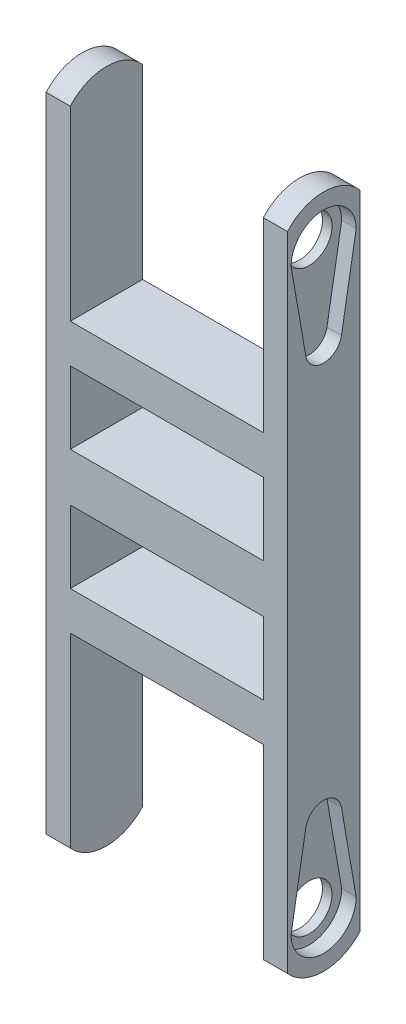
ISO-10303-21;
HEADER;
FILE_DESCRIPTION(('STEP AP214'),'2;1');
FILE_NAME('part.step','',(''),(''),'','','');
FILE_SCHEMA(('AUTOMOTIVE_DESIGN { 1 0 10303 214 1 1 1 1 }'));
ENDSEC;
DATA;
#1=APPLICATION_CONTEXT('core data for automotive mechanical design processes');
#2=APPLICATION_PROTOCOL_DEFINITION('international standard','automotive_design',2000,#1);
#3=PRODUCT_CONTEXT('',#1,'mechanical');
#4=PRODUCT('Part','Part','',(#3));
#5=PRODUCT_RELATED_PRODUCT_CATEGORY('part','',(#4));
#6=PRODUCT_DEFINITION_FORMATION('','',#4);
#7=PRODUCT_DEFINITION_CONTEXT('part definition',#1,'design');
#8=PRODUCT_DEFINITION('design','',#6,#7);
#9=PRODUCT_DEFINITION_SHAPE('','',#8);
#10=(LENGTH_UNIT() NAMED_UNIT(*) SI_UNIT(.MILLI.,.METRE.));
#11=(NAMED_UNIT(*) PLANE_ANGLE_UNIT() SI_UNIT($,.RADIAN.));
#12=(NAMED_UNIT(*) SI_UNIT($,.STERADIAN.) SOLID_ANGLE_UNIT());
#13=UNCERTAINTY_MEASURE_WITH_UNIT(LENGTH_MEASURE(1.E-05),#10,'distance_accuracy_value','');
#14=(GEOMETRIC_REPRESENTATION_CONTEXT(3) GLOBAL_UNCERTAINTY_ASSIGNED_CONTEXT((#13)) GLOBAL_UNIT_ASSIGNED_CONTEXT((#10,
#11,#12)) REPRESENTATION_CONTEXT('',''));
#15=CARTESIAN_POINT('',(0.,0.,0.));
#16=DIRECTION('',(0.,0.,1.));
#17=DIRECTION('',(1.,0.,0.));
#18=AXIS2_PLACEMENT_3D('',#15,#16,#17);
#19=CARTESIAN_POINT('',(-30.001,60.,7.49999999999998));
#20=DIRECTION('',(1.,0.,0.));
#21=DIRECTION('',(0.,0.,-1.));
#22=AXIS2_PLACEMENT_3D('',#19,#20,#21);
#23=CYLINDRICAL_SURFACE('',#22,4.75);
#24=CARTESIAN_POINT('',(20.025,60.,7.49999999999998));
#25=DIRECTION('',(1.,0.,0.));
#26=DIRECTION('',(0.,1.,0.));
#27=AXIS2_PLACEMENT_3D('',#24,#25,#26);
#28=CIRCLE('',#27,4.75);
#29=CARTESIAN_POINT('',(20.025,64.75,7.49999999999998));
#30=VERTEX_POINT('',#29);
#31=EDGE_CURVE('E309',#30,#30,#28,.F.);
#32=ORIENTED_EDGE('',*,*,#31,.T.);
#33=EDGE_LOOP('',(#32));
#34=FACE_BOUND('',#33,.T.);
#35=CARTESIAN_POINT('',(22.0125,60.,7.49999999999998));
#36=DIRECTION('',(1.,0.,0.));
#37=DIRECTION('',(0.,0.,-1.));
#38=AXIS2_PLACEMENT_3D('',#35,#36,#37);
#39=CIRCLE('',#38,4.75);
#40=CARTESIAN_POINT('',(22.0125,60.,2.74999999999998));
#41=VERTEX_POINT('',#40);
#42=EDGE_CURVE('E38',#41,#41,#39,.F.);
#43=ORIENTED_EDGE('',*,*,#42,.F.);
#44=EDGE_LOOP('',(#43));
#45=FACE_BOUND('',#44,.T.);
#46=ADVANCED_FACE('F34',(#34,#45),#23,.F.);
#47=CARTESIAN_POINT('',(-20.025,-70.,0.));
#48=DIRECTION('',(-1.,0.,0.));
#49=DIRECTION('',(0.,-1.,0.));
#50=AXIS2_PLACEMENT_3D('',#47,#48,#49);
#51=PLANE('',#50);
#52=DIRECTION('',(0.,-1.,0.));
#53=VECTOR('',#52,1.);
#54=CARTESIAN_POINT('',(-20.025,-70.,15.));
#55=LINE('',#54,#53);
#56=CARTESIAN_POINT('',(-20.025,-28.,15.));
#57=VERTEX_POINT('',#56);
#58=CARTESIAN_POINT('',(-20.025,-66.6143782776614,15.));
#59=VERTEX_POINT('',#58);
#60=EDGE_CURVE('E361',#57,#59,#55,.T.);
#61=ORIENTED_EDGE('',*,*,#60,.T.);
#62=CARTESIAN_POINT('',(-20.025,-60.,7.49999999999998));
#63=DIRECTION('',(-1.,0.,0.));
#64=DIRECTION('',(0.,-1.,0.));
#65=AXIS2_PLACEMENT_3D('',#62,#63,#64);
#66=CIRCLE('',#65,10.);
#67=CARTESIAN_POINT('',(-20.025,-66.6143782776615,0.));
#68=VERTEX_POINT('',#67);
#69=EDGE_CURVE('E330',#59,#68,#66,.F.);
#70=ORIENTED_EDGE('',*,*,#69,.T.);
#71=DIRECTION('',(0.,-1.,0.));
#72=VECTOR('',#71,1.);
#73=CARTESIAN_POINT('',(-20.025,-70.,0.));
#74=LINE('',#73,#72);
#75=CARTESIAN_POINT('',(-20.025,-28.,0.));
#76=VERTEX_POINT('',#75);
#77=EDGE_CURVE('E422',#76,#68,#74,.T.);
#78=ORIENTED_EDGE('',*,*,#77,.F.);
#79=DIRECTION('',(0.,0.,1.));
#80=VECTOR('',#79,1.);
#81=CARTESIAN_POINT('',(-20.025,-28.,0.));
#82=LINE('',#81,#80);
#83=EDGE_CURVE('E412',#76,#57,#82,.T.);
#84=ORIENTED_EDGE('',*,*,#83,.T.);
#85=EDGE_LOOP('',(#61,#70,#78,#84));
#86=FACE_BOUND('',#85,.T.);
#87=ADVANCED_FACE('F451',(#86),#51,.F.);
#88=CARTESIAN_POINT('',(20.025,-70.,0.));
#89=DIRECTION('',(1.,0.,0.));
#90=DIRECTION('',(0.,1.,0.));
#91=AXIS2_PLACEMENT_3D('',#88,#89,#90);
#92=PLANE('',#91);
#93=CARTESIAN_POINT('',(20.025,-60.,7.49999999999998));
#94=DIRECTION('',(1.,0.,0.));
#95=DIRECTION('',(0.,1.,0.));
#96=AXIS2_PLACEMENT_3D('',#93,#94,#95);
#97=CIRCLE('',#96,4.75);
#98=CARTESIAN_POINT('',(20.025,-55.25,7.49999999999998));
#99=VERTEX_POINT('',#98);
#100=EDGE_CURVE('E308',#99,#99,#97,.F.);
#101=ORIENTED_EDGE('',*,*,#100,.F.);
#102=EDGE_LOOP('',(#101));
#103=FACE_BOUND('',#102,.T.);
#104=DIRECTION('',(0.,1.,0.));
#105=VECTOR('',#104,1.);
#106=CARTESIAN_POINT('',(20.025,-70.,0.));
#107=LINE('',#106,#105);
#108=CARTESIAN_POINT('',(20.025,-66.6143782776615,0.));
#109=VERTEX_POINT('',#108);
#110=CARTESIAN_POINT('',(20.025,-28.,0.));
#111=VERTEX_POINT('',#110);
#112=EDGE_CURVE('E425',#109,#111,#107,.T.);
#113=ORIENTED_EDGE('',*,*,#112,.F.);
#114=CARTESIAN_POINT('',(20.025,-60.,7.49999999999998));
#115=DIRECTION('',(1.,0.,0.));
#116=DIRECTION('',(0.,1.,0.));
#117=AXIS2_PLACEMENT_3D('',#114,#115,#116);
#118=CIRCLE('',#117,10.);
#119=CARTESIAN_POINT('',(20.025,-66.6143782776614,15.));
#120=VERTEX_POINT('',#119);
#121=EDGE_CURVE('E43',#109,#120,#118,.F.);
#122=ORIENTED_EDGE('',*,*,#121,.T.);
#123=DIRECTION('',(0.,1.,0.));
#124=VECTOR('',#123,1.);
#125=CARTESIAN_POINT('',(20.025,-70.,15.));
#126=LINE('',#125,#124);
#127=CARTESIAN_POINT('',(20.025,-28.,15.));
#128=VERTEX_POINT('',#127);
#129=EDGE_CURVE('E434',#120,#128,#126,.T.);
#130=ORIENTED_EDGE('',*,*,#129,.T.);
#131=DIRECTION('',(0.,0.,1.));
#132=VECTOR('',#131,1.);
#133=CARTESIAN_POINT('',(20.025,-28.,0.));
#134=LINE('',#133,#132);
#135=EDGE_CURVE('E431',#111,#128,#134,.T.);
#136=ORIENTED_EDGE('',*,*,#135,.F.);
#137=EDGE_LOOP('',(#113,#122,#130,#136));
#138=FACE_BOUND('',#137,.T.);
#139=ADVANCED_FACE('F457',(#103,#138),#92,.F.);
#140=CARTESIAN_POINT('',(-20.025,70.,0.));
#141=DIRECTION('',(-1.,0.,0.));
#142=DIRECTION('',(0.,-1.,0.));
#143=AXIS2_PLACEMENT_3D('',#140,#141,#142);
#144=PLANE('',#143);
#145=DIRECTION('',(0.,-1.,0.));
#146=VECTOR('',#145,1.);
#147=CARTESIAN_POINT('',(-20.025,70.,0.));
#148=LINE('',#147,#146);
#149=CARTESIAN_POINT('',(-20.025,66.6143782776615,0.));
#150=VERTEX_POINT('',#149);
#151=CARTESIAN_POINT('',(-20.025,28.,0.));
#152=VERTEX_POINT('',#151);
#153=EDGE_CURVE('E399',#150,#152,#148,.T.);
#154=ORIENTED_EDGE('',*,*,#153,.F.);
#155=CARTESIAN_POINT('',(-20.025,60.,7.49999999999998));
#156=DIRECTION('',(-1.,0.,0.));
#157=DIRECTION('',(0.,-1.,0.));
#158=AXIS2_PLACEMENT_3D('',#155,#156,#157);
#159=CIRCLE('',#158,10.);
#160=CARTESIAN_POINT('',(-20.025,66.6143782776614,15.));
#161=VERTEX_POINT('',#160);
#162=EDGE_CURVE('E319',#150,#161,#159,.F.);
#163=ORIENTED_EDGE('',*,*,#162,.T.);
#164=DIRECTION('',(0.,-1.,0.));
#165=VECTOR('',#164,1.);
#166=CARTESIAN_POINT('',(-20.025,70.,15.));
#167=LINE('',#166,#165);
#168=CARTESIAN_POINT('',(-20.025,28.,15.));
#169=VERTEX_POINT('',#168);
#170=EDGE_CURVE('E409',#161,#169,#167,.T.);
#171=ORIENTED_EDGE('',*,*,#170,.T.);
#172=DIRECTION('',(0.,0.,1.));
#173=VECTOR('',#172,1.);
#174=CARTESIAN_POINT('',(-20.025,28.,0.));
#175=LINE('',#174,#173);
#176=EDGE_CURVE('E408',#152,#169,#175,.T.);
#177=ORIENTED_EDGE('',*,*,#176,.F.);
#178=EDGE_LOOP('',(#154,#163,#171,#177));
#179=FACE_BOUND('',#178,.T.);
#180=ADVANCED_FACE('F514',(#179),#144,.F.);
#181=CARTESIAN_POINT('',(20.025,70.,0.));
#182=DIRECTION('',(1.,0.,0.));
#183=DIRECTION('',(0.,1.,0.));
#184=AXIS2_PLACEMENT_3D('',#181,#182,#183);
#185=PLANE('',#184);
#186=ORIENTED_EDGE('',*,*,#31,.F.);
#187=EDGE_LOOP('',(#186));
#188=FACE_BOUND('',#187,.T.);
#189=CARTESIAN_POINT('',(20.025,60.,7.49999999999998));
#190=DIRECTION('',(1.,0.,0.));
#191=DIRECTION('',(0.,1.,0.));
#192=AXIS2_PLACEMENT_3D('',#189,#190,#191);
#193=CIRCLE('',#192,10.);
#194=CARTESIAN_POINT('',(20.025,66.6143782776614,15.));
#195=VERTEX_POINT('',#194);
#196=CARTESIAN_POINT('',(20.025,66.6143782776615,0.));
#197=VERTEX_POINT('',#196);
#198=EDGE_CURVE('E419',#195,#197,#193,.F.);
#199=ORIENTED_EDGE('',*,*,#198,.T.);
#200=DIRECTION('',(0.,1.,0.));
#201=VECTOR('',#200,1.);
#202=CARTESIAN_POINT('',(20.025,70.,0.));
#203=LINE('',#202,#201);
#204=CARTESIAN_POINT('',(20.025,28.,0.));
#205=VERTEX_POINT('',#204);
#206=EDGE_CURVE('E405',#205,#197,#203,.T.);
#207=ORIENTED_EDGE('',*,*,#206,.F.);
#208=DIRECTION('',(0.,0.,1.));
#209=VECTOR('',#208,1.);
#210=CARTESIAN_POINT('',(20.025,28.,0.));
#211=LINE('',#210,#209);
#212=CARTESIAN_POINT('',(20.025,28.,15.));
#213=VERTEX_POINT('',#212);
#214=EDGE_CURVE('E417',#205,#213,#211,.T.);
#215=ORIENTED_EDGE('',*,*,#214,.T.);
#216=DIRECTION('',(0.,1.,0.));
#217=VECTOR('',#216,1.);
#218=CARTESIAN_POINT('',(20.025,70.,15.));
#219=LINE('',#218,#217);
#220=EDGE_CURVE('E402',#213,#195,#219,.T.);
#221=ORIENTED_EDGE('',*,*,#220,.T.);
#222=EDGE_LOOP('',(#199,#207,#215,#221));
#223=FACE_BOUND('',#222,.T.);
#224=ADVANCED_FACE('F510',(#188,#223),#185,.F.);
#225=CARTESIAN_POINT('',(0.,0.,15.));
#226=DIRECTION('',(0.,0.,-1.));
#227=DIRECTION('',(-1.,0.,0.));
#228=AXIS2_PLACEMENT_3D('',#225,#226,#227);
#229=PLANE('',#228);
#230=DIRECTION('',(1.,0.,0.));
#231=VECTOR('',#230,1.);
#232=CARTESIAN_POINT('',(-20.025,-20.,15.));
#233=LINE('',#232,#231);
#234=CARTESIAN_POINT('',(-20.025,-20.,15.));
#235=VERTEX_POINT('',#234);
#236=CARTESIAN_POINT('',(20.025,-20.,15.));
#237=VERTEX_POINT('',#236);
#238=EDGE_CURVE('E350',#235,#237,#233,.T.);
#239=ORIENTED_EDGE('',*,*,#238,.F.);
#240=DIRECTION('',(0.,-1.,0.));
#241=VECTOR('',#240,1.);
#242=CARTESIAN_POINT('',(-20.025,-20.,15.));
#243=LINE('',#242,#241);
#244=CARTESIAN_POINT('',(-20.025,-4.99999999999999,15.));
#245=VERTEX_POINT('',#244);
#246=EDGE_CURVE('E348',#245,#235,#243,.T.);
#247=ORIENTED_EDGE('',*,*,#246,.F.);
#248=DIRECTION('',(-1.,0.,0.));
#249=VECTOR('',#248,1.);
#250=CARTESIAN_POINT('',(-20.025,-4.99999999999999,15.));
#251=LINE('',#250,#249);
#252=CARTESIAN_POINT('',(20.025,-4.99999999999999,15.));
#253=VERTEX_POINT('',#252);
#254=EDGE_CURVE('E338',#253,#245,#251,.T.);
#255=ORIENTED_EDGE('',*,*,#254,.F.);
#256=DIRECTION('',(0.,1.,0.));
#257=VECTOR('',#256,1.);
#258=CARTESIAN_POINT('',(20.025,-20.,15.));
#259=LINE('',#258,#257);
#260=EDGE_CURVE('E354',#237,#253,#259,.T.);
#261=ORIENTED_EDGE('',*,*,#260,.F.);
#262=EDGE_LOOP('',(#239,#247,#255,#261));
#263=FACE_BOUND('',#262,.T.);
#264=DIRECTION('',(1.,0.,0.));
#265=VECTOR('',#264,1.);
#266=CARTESIAN_POINT('',(-20.025,4.99999999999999,15.));
#267=LINE('',#266,#265);
#268=CARTESIAN_POINT('',(-20.025,4.99999999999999,15.));
#269=VERTEX_POINT('',#268);
#270=CARTESIAN_POINT('',(20.025,4.99999999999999,15.));
#271=VERTEX_POINT('',#270);
#272=EDGE_CURVE('E384',#269,#271,#267,.T.);
#273=ORIENTED_EDGE('',*,*,#272,.F.);
#274=DIRECTION('',(0.,-1.,0.));
#275=VECTOR('',#274,1.);
#276=CARTESIAN_POINT('',(-20.025,20.,15.));
#277=LINE('',#276,#275);
#278=CARTESIAN_POINT('',(-20.025,20.,15.));
#279=VERTEX_POINT('',#278);
#280=EDGE_CURVE('E382',#279,#269,#277,.T.);
#281=ORIENTED_EDGE('',*,*,#280,.F.);
#282=DIRECTION('',(-1.,0.,0.));
#283=VECTOR('',#282,1.);
#284=CARTESIAN_POINT('',(-20.025,20.,15.));
#285=LINE('',#284,#283);
#286=CARTESIAN_POINT('',(20.025,20.,15.));
#287=VERTEX_POINT('',#286);
#288=EDGE_CURVE('E372',#287,#279,#285,.T.);
#289=ORIENTED_EDGE('',*,*,#288,.F.);
#290=DIRECTION('',(0.,1.,0.));
#291=VECTOR('',#290,1.);
#292=CARTESIAN_POINT('',(20.025,20.,15.));
#293=LINE('',#292,#291);
#294=EDGE_CURVE('E387',#271,#287,#293,.T.);
#295=ORIENTED_EDGE('',*,*,#294,.F.);
#296=EDGE_LOOP('',(#273,#281,#289,#295));
#297=FACE_BOUND('',#296,.T.);
#298=DIRECTION('',(-1.,0.,0.));
#299=VECTOR('',#298,1.);
#300=CARTESIAN_POINT('',(30.,66.6143782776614,15.));
#301=LINE('',#300,#299);
#302=CARTESIAN_POINT('',(-25.0125,66.6143782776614,15.));
#303=VERTEX_POINT('',#302);
#304=EDGE_CURVE('E320',#161,#303,#301,.T.);
#305=ORIENTED_EDGE('',*,*,#304,.T.);
#306=DIRECTION('',(0.,-1.,0.));
#307=VECTOR('',#306,1.);
#308=CARTESIAN_POINT('',(-25.0125,70.,15.));
#309=LINE('',#308,#307);
#310=CARTESIAN_POINT('',(-25.0125,-66.6143782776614,15.));
#311=VERTEX_POINT('',#310);
#312=EDGE_CURVE('E291',#303,#311,#309,.T.);
#313=ORIENTED_EDGE('',*,*,#312,.T.);
#314=DIRECTION('',(-1.,0.,0.));
#315=VECTOR('',#314,1.);
#316=CARTESIAN_POINT('',(30.,-66.6143782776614,15.));
#317=LINE('',#316,#315);
#318=EDGE_CURVE('E331',#311,#59,#317,.F.);
#319=ORIENTED_EDGE('',*,*,#318,.T.);
#320=ORIENTED_EDGE('',*,*,#60,.F.);
#321=DIRECTION('',(-1.,0.,0.));
#322=VECTOR('',#321,1.);
#323=CARTESIAN_POINT('',(-20.025,-28.,15.));
#324=LINE('',#323,#322);
#325=EDGE_CURVE('E426',#128,#57,#324,.T.);
#326=ORIENTED_EDGE('',*,*,#325,.F.);
#327=ORIENTED_EDGE('',*,*,#129,.F.);
#328=CARTESIAN_POINT('',(25.0125,-66.6143782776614,15.));
#329=VERTEX_POINT('',#328);
#330=EDGE_CURVE('E326',#120,#329,#317,.F.);
#331=ORIENTED_EDGE('',*,*,#330,.T.);
#332=DIRECTION('',(0.,1.,0.));
#333=VECTOR('',#332,1.);
#334=CARTESIAN_POINT('',(25.0125,70.,15.));
#335=LINE('',#334,#333);
#336=CARTESIAN_POINT('',(25.0125,66.6143782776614,15.));
#337=VERTEX_POINT('',#336);
#338=EDGE_CURVE('E297',#329,#337,#335,.T.);
#339=ORIENTED_EDGE('',*,*,#338,.T.);
#340=EDGE_CURVE('E316',#337,#195,#301,.T.);
#341=ORIENTED_EDGE('',*,*,#340,.T.);
#342=ORIENTED_EDGE('',*,*,#220,.F.);
#343=DIRECTION('',(1.,0.,0.));
#344=VECTOR('',#343,1.);
#345=CARTESIAN_POINT('',(-20.025,28.,15.));
#346=LINE('',#345,#344);
#347=EDGE_CURVE('E411',#169,#213,#346,.T.);
#348=ORIENTED_EDGE('',*,*,#347,.F.);
#349=ORIENTED_EDGE('',*,*,#170,.F.);
#350=EDGE_LOOP('',(#305,#313,#319,#320,#326,#327,#331,#339,#341,#342,#348,#349));
#351=FACE_BOUND('',#350,.T.);
#352=ADVANCED_FACE('F513',(#263,#297,#351),#229,.F.);
#353=CARTESIAN_POINT('',(0.,0.,0.));
#354=DIRECTION('',(0.,0.,-1.));
#355=DIRECTION('',(-1.,0.,0.));
#356=AXIS2_PLACEMENT_3D('',#353,#354,#355);
#357=PLANE('',#356);
#358=DIRECTION('',(0.,-1.,0.));
#359=VECTOR('',#358,1.);
#360=CARTESIAN_POINT('',(-25.0125,70.,0.));
#361=LINE('',#360,#359);
#362=CARTESIAN_POINT('',(-25.0125,66.6143782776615,0.));
#363=VERTEX_POINT('',#362);
#364=CARTESIAN_POINT('',(-25.0125,-66.6143782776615,0.));
#365=VERTEX_POINT('',#364);
#366=EDGE_CURVE('E295',#363,#365,#361,.T.);
#367=ORIENTED_EDGE('',*,*,#366,.F.);
#368=DIRECTION('',(-1.,0.,0.));
#369=VECTOR('',#368,1.);
#370=CARTESIAN_POINT('',(30.,66.6143782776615,0.));
#371=LINE('',#370,#369);
#372=EDGE_CURVE('E317',#150,#363,#371,.T.);
#373=ORIENTED_EDGE('',*,*,#372,.F.);
#374=ORIENTED_EDGE('',*,*,#153,.T.);
#375=DIRECTION('',(1.,0.,0.));
#376=VECTOR('',#375,1.);
#377=CARTESIAN_POINT('',(-20.025,28.,0.));
#378=LINE('',#377,#376);
#379=EDGE_CURVE('E401',#152,#205,#378,.T.);
#380=ORIENTED_EDGE('',*,*,#379,.T.);
#381=ORIENTED_EDGE('',*,*,#206,.T.);
#382=CARTESIAN_POINT('',(25.0125,66.6143782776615,0.));
#383=VERTEX_POINT('',#382);
#384=EDGE_CURVE('E312',#383,#197,#371,.T.);
#385=ORIENTED_EDGE('',*,*,#384,.F.);
#386=DIRECTION('',(0.,1.,0.));
#387=VECTOR('',#386,1.);
#388=CARTESIAN_POINT('',(25.0125,70.,0.));
#389=LINE('',#388,#387);
#390=CARTESIAN_POINT('',(25.0125,-66.6143782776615,0.));
#391=VERTEX_POINT('',#390);
#392=EDGE_CURVE('E300',#391,#383,#389,.T.);
#393=ORIENTED_EDGE('',*,*,#392,.F.);
#394=DIRECTION('',(-1.,0.,0.));
#395=VECTOR('',#394,1.);
#396=CARTESIAN_POINT('',(30.,-66.6143782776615,0.));
#397=LINE('',#396,#395);
#398=EDGE_CURVE('E323',#109,#391,#397,.F.);
#399=ORIENTED_EDGE('',*,*,#398,.F.);
#400=ORIENTED_EDGE('',*,*,#112,.T.);
#401=DIRECTION('',(-1.,0.,0.));
#402=VECTOR('',#401,1.);
#403=CARTESIAN_POINT('',(-20.025,-28.,0.));
#404=LINE('',#403,#402);
#405=EDGE_CURVE('E428',#111,#76,#404,.T.);
#406=ORIENTED_EDGE('',*,*,#405,.T.);
#407=ORIENTED_EDGE('',*,*,#77,.T.);
#408=EDGE_CURVE('E327',#365,#68,#397,.F.);
#409=ORIENTED_EDGE('',*,*,#408,.F.);
#410=EDGE_LOOP('',(#367,#373,#374,#380,#381,#385,#393,#399,#400,#406,#407,#409));
#411=FACE_BOUND('',#410,.T.);
#412=DIRECTION('',(0.,-1.,0.));
#413=VECTOR('',#412,1.);
#414=CARTESIAN_POINT('',(-20.025,-20.,0.));
#415=LINE('',#414,#413);
#416=CARTESIAN_POINT('',(-20.025,-4.99999999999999,0.));
#417=VERTEX_POINT('',#416);
#418=CARTESIAN_POINT('',(-20.025,-20.,0.));
#419=VERTEX_POINT('',#418);
#420=EDGE_CURVE('E334',#417,#419,#415,.T.);
#421=ORIENTED_EDGE('',*,*,#420,.T.);
#422=DIRECTION('',(1.,0.,0.));
#423=VECTOR('',#422,1.);
#424=CARTESIAN_POINT('',(-20.025,-20.,0.));
#425=LINE('',#424,#423);
#426=CARTESIAN_POINT('',(20.025,-20.,0.));
#427=VERTEX_POINT('',#426);
#428=EDGE_CURVE('E337',#419,#427,#425,.T.);
#429=ORIENTED_EDGE('',*,*,#428,.T.);
#430=DIRECTION('',(0.,1.,0.));
#431=VECTOR('',#430,1.);
#432=CARTESIAN_POINT('',(20.025,-20.,0.));
#433=LINE('',#432,#431);
#434=CARTESIAN_POINT('',(20.025,-4.99999999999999,0.));
#435=VERTEX_POINT('',#434);
#436=EDGE_CURVE('E341',#427,#435,#433,.T.);
#437=ORIENTED_EDGE('',*,*,#436,.T.);
#438=DIRECTION('',(-1.,0.,0.));
#439=VECTOR('',#438,1.);
#440=CARTESIAN_POINT('',(-20.025,-4.99999999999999,0.));
#441=LINE('',#440,#439);
#442=EDGE_CURVE('E344',#435,#417,#441,.T.);
#443=ORIENTED_EDGE('',*,*,#442,.T.);
#444=EDGE_LOOP('',(#421,#429,#437,#443));
#445=FACE_BOUND('',#444,.T.);
#446=DIRECTION('',(0.,-1.,0.));
#447=VECTOR('',#446,1.);
#448=CARTESIAN_POINT('',(-20.025,20.,0.));
#449=LINE('',#448,#447);
#450=CARTESIAN_POINT('',(-20.025,20.,0.));
#451=VERTEX_POINT('',#450);
#452=CARTESIAN_POINT('',(-20.025,4.99999999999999,0.));
#453=VERTEX_POINT('',#452);
#454=EDGE_CURVE('E368',#451,#453,#449,.T.);
#455=ORIENTED_EDGE('',*,*,#454,.T.);
#456=DIRECTION('',(1.,0.,0.));
#457=VECTOR('',#456,1.);
#458=CARTESIAN_POINT('',(-20.025,4.99999999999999,0.));
#459=LINE('',#458,#457);
#460=CARTESIAN_POINT('',(20.025,4.99999999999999,0.));
#461=VERTEX_POINT('',#460);
#462=EDGE_CURVE('E371',#453,#461,#459,.T.);
#463=ORIENTED_EDGE('',*,*,#462,.T.);
#464=DIRECTION('',(0.,1.,0.));
#465=VECTOR('',#464,1.);
#466=CARTESIAN_POINT('',(20.025,20.,0.));
#467=LINE('',#466,#465);
#468=CARTESIAN_POINT('',(20.025,20.,0.));
#469=VERTEX_POINT('',#468);
#470=EDGE_CURVE('E375',#461,#469,#467,.T.);
#471=ORIENTED_EDGE('',*,*,#470,.T.);
#472=DIRECTION('',(-1.,0.,0.));
#473=VECTOR('',#472,1.);
#474=CARTESIAN_POINT('',(-20.025,20.,0.));
#475=LINE('',#474,#473);
#476=EDGE_CURVE('E378',#469,#451,#475,.T.);
#477=ORIENTED_EDGE('',*,*,#476,.T.);
#478=EDGE_LOOP('',(#455,#463,#471,#477));
#479=FACE_BOUND('',#478,.T.);
#480=ADVANCED_FACE('F36',(#411,#445,#479),#357,.T.);
#481=CARTESIAN_POINT('',(-20.025,-28.,0.));
#482=DIRECTION('',(0.,1.,0.));
#483=DIRECTION('',(0.,0.,1.));
#484=AXIS2_PLACEMENT_3D('',#481,#482,#483);
#485=PLANE('',#484);
#486=ORIENTED_EDGE('',*,*,#325,.T.);
#487=ORIENTED_EDGE('',*,*,#83,.F.);
#488=ORIENTED_EDGE('',*,*,#405,.F.);
#489=ORIENTED_EDGE('',*,*,#135,.T.);
#490=EDGE_LOOP('',(#486,#487,#488,#489));
#491=FACE_BOUND('',#490,.T.);
#492=ADVANCED_FACE('F518',(#491),#485,.F.);
#493=CARTESIAN_POINT('',(-20.025,28.,0.));
#494=DIRECTION('',(0.,-1.,0.));
#495=DIRECTION('',(0.,0.,-1.));
#496=AXIS2_PLACEMENT_3D('',#493,#494,#495);
#497=PLANE('',#496);
#498=ORIENTED_EDGE('',*,*,#347,.T.);
#499=ORIENTED_EDGE('',*,*,#214,.F.);
#500=ORIENTED_EDGE('',*,*,#379,.F.);
#501=ORIENTED_EDGE('',*,*,#176,.T.);
#502=EDGE_LOOP('',(#498,#499,#500,#501));
#503=FACE_BOUND('',#502,.T.);
#504=ADVANCED_FACE('F508',(#503),#497,.F.);
#505=CARTESIAN_POINT('',(-20.025,20.,0.));
#506=DIRECTION('',(-1.,0.,0.));
#507=DIRECTION('',(0.,0.,1.));
#508=AXIS2_PLACEMENT_3D('',#505,#506,#507);
#509=PLANE('',#508);
#510=ORIENTED_EDGE('',*,*,#280,.T.);
#511=DIRECTION('',(0.,0.,1.));
#512=VECTOR('',#511,1.);
#513=CARTESIAN_POINT('',(-20.025,4.99999999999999,0.));
#514=LINE('',#513,#512);
#515=EDGE_CURVE('E381',#453,#269,#514,.T.);
#516=ORIENTED_EDGE('',*,*,#515,.F.);
#517=ORIENTED_EDGE('',*,*,#454,.F.);
#518=DIRECTION('',(0.,0.,1.));
#519=VECTOR('',#518,1.);
#520=CARTESIAN_POINT('',(-20.025,20.,0.));
#521=LINE('',#520,#519);
#522=EDGE_CURVE('E351',#451,#279,#521,.T.);
#523=ORIENTED_EDGE('',*,*,#522,.T.);
#524=EDGE_LOOP('',(#510,#516,#517,#523));
#525=FACE_BOUND('',#524,.T.);
#526=ADVANCED_FACE('F498',(#525),#509,.F.);
#527=CARTESIAN_POINT('',(-20.025,20.,0.));
#528=DIRECTION('',(0.,1.,0.));
#529=DIRECTION('',(0.,0.,1.));
#530=AXIS2_PLACEMENT_3D('',#527,#528,#529);
#531=PLANE('',#530);
#532=ORIENTED_EDGE('',*,*,#288,.T.);
#533=ORIENTED_EDGE('',*,*,#522,.F.);
#534=ORIENTED_EDGE('',*,*,#476,.F.);
#535=DIRECTION('',(0.,0.,1.));
#536=VECTOR('',#535,1.);
#537=CARTESIAN_POINT('',(20.025,20.,0.));
#538=LINE('',#537,#536);
#539=EDGE_CURVE('E393',#469,#287,#538,.T.);
#540=ORIENTED_EDGE('',*,*,#539,.T.);
#541=EDGE_LOOP('',(#532,#533,#534,#540));
#542=FACE_BOUND('',#541,.T.);
#543=ADVANCED_FACE('F494',(#542),#531,.F.);
#544=CARTESIAN_POINT('',(20.025,20.,0.));
#545=DIRECTION('',(1.,0.,0.));
#546=DIRECTION('',(0.,0.,-1.));
#547=AXIS2_PLACEMENT_3D('',#544,#545,#546);
#548=PLANE('',#547);
#549=ORIENTED_EDGE('',*,*,#294,.T.);
#550=ORIENTED_EDGE('',*,*,#539,.F.);
#551=ORIENTED_EDGE('',*,*,#470,.F.);
#552=DIRECTION('',(0.,0.,1.));
#553=VECTOR('',#552,1.);
#554=CARTESIAN_POINT('',(20.025,4.99999999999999,0.));
#555=LINE('',#554,#553);
#556=EDGE_CURVE('E395',#461,#271,#555,.T.);
#557=ORIENTED_EDGE('',*,*,#556,.T.);
#558=EDGE_LOOP('',(#549,#550,#551,#557));
#559=FACE_BOUND('',#558,.T.);
#560=ADVANCED_FACE('F497',(#559),#548,.F.);
#561=CARTESIAN_POINT('',(-20.025,4.99999999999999,0.));
#562=DIRECTION('',(0.,-1.,0.));
#563=DIRECTION('',(0.,0.,-1.));
#564=AXIS2_PLACEMENT_3D('',#561,#562,#563);
#565=PLANE('',#564);
#566=ORIENTED_EDGE('',*,*,#272,.T.);
#567=ORIENTED_EDGE('',*,*,#556,.F.);
#568=ORIENTED_EDGE('',*,*,#462,.F.);
#569=ORIENTED_EDGE('',*,*,#515,.T.);
#570=EDGE_LOOP('',(#566,#567,#568,#569));
#571=FACE_BOUND('',#570,.T.);
#572=ADVANCED_FACE('F492',(#571),#565,.F.);
#573=CARTESIAN_POINT('',(-20.025,-20.,0.));
#574=DIRECTION('',(-1.,0.,0.));
#575=DIRECTION('',(0.,0.,1.));
#576=AXIS2_PLACEMENT_3D('',#573,#574,#575);
#577=PLANE('',#576);
#578=ORIENTED_EDGE('',*,*,#246,.T.);
#579=DIRECTION('',(0.,0.,1.));
#580=VECTOR('',#579,1.);
#581=CARTESIAN_POINT('',(-20.025,-20.,0.));
#582=LINE('',#581,#580);
#583=EDGE_CURVE('E347',#419,#235,#582,.T.);
#584=ORIENTED_EDGE('',*,*,#583,.F.);
#585=ORIENTED_EDGE('',*,*,#420,.F.);
#586=DIRECTION('',(0.,0.,1.));
#587=VECTOR('',#586,1.);
#588=CARTESIAN_POINT('',(-20.025,-4.99999999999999,0.));
#589=LINE('',#588,#587);
#590=EDGE_CURVE('E359',#417,#245,#589,.T.);
#591=ORIENTED_EDGE('',*,*,#590,.T.);
#592=EDGE_LOOP('',(#578,#584,#585,#591));
#593=FACE_BOUND('',#592,.T.);
#594=ADVANCED_FACE('F481',(#593),#577,.F.);
#595=CARTESIAN_POINT('',(-20.025,-4.99999999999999,0.));
#596=DIRECTION('',(0.,1.,0.));
#597=DIRECTION('',(0.,0.,1.));
#598=AXIS2_PLACEMENT_3D('',#595,#596,#597);
#599=PLANE('',#598);
#600=ORIENTED_EDGE('',*,*,#254,.T.);
#601=ORIENTED_EDGE('',*,*,#590,.F.);
#602=ORIENTED_EDGE('',*,*,#442,.F.);
#603=DIRECTION('',(0.,0.,1.));
#604=VECTOR('',#603,1.);
#605=CARTESIAN_POINT('',(20.025,-4.99999999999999,0.));
#606=LINE('',#605,#604);
#607=EDGE_CURVE('E362',#435,#253,#606,.T.);
#608=ORIENTED_EDGE('',*,*,#607,.T.);
#609=EDGE_LOOP('',(#600,#601,#602,#608));
#610=FACE_BOUND('',#609,.T.);
#611=ADVANCED_FACE('F477',(#610),#599,.F.);
#612=CARTESIAN_POINT('',(20.025,-20.,0.));
#613=DIRECTION('',(1.,0.,0.));
#614=DIRECTION('',(0.,0.,-1.));
#615=AXIS2_PLACEMENT_3D('',#612,#613,#614);
#616=PLANE('',#615);
#617=ORIENTED_EDGE('',*,*,#260,.T.);
#618=ORIENTED_EDGE('',*,*,#607,.F.);
#619=ORIENTED_EDGE('',*,*,#436,.F.);
#620=DIRECTION('',(0.,0.,1.));
#621=VECTOR('',#620,1.);
#622=CARTESIAN_POINT('',(20.025,-20.,0.));
#623=LINE('',#622,#621);
#624=EDGE_CURVE('E364',#427,#237,#623,.T.);
#625=ORIENTED_EDGE('',*,*,#624,.T.);
#626=EDGE_LOOP('',(#617,#618,#619,#625));
#627=FACE_BOUND('',#626,.T.);
#628=ADVANCED_FACE('F480',(#627),#616,.F.);
#629=CARTESIAN_POINT('',(-20.025,-20.,0.));
#630=DIRECTION('',(0.,-1.,0.));
#631=DIRECTION('',(0.,0.,-1.));
#632=AXIS2_PLACEMENT_3D('',#629,#630,#631);
#633=PLANE('',#632);
#634=ORIENTED_EDGE('',*,*,#238,.T.);
#635=ORIENTED_EDGE('',*,*,#624,.F.);
#636=ORIENTED_EDGE('',*,*,#428,.F.);
#637=ORIENTED_EDGE('',*,*,#583,.T.);
#638=EDGE_LOOP('',(#634,#635,#636,#637));
#639=FACE_BOUND('',#638,.T.);
#640=ADVANCED_FACE('F485',(#639),#633,.F.);
#641=CARTESIAN_POINT('',(30.,60.,7.49999999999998));
#642=DIRECTION('',(-1.,0.,0.));
#643=DIRECTION('',(0.,0.,1.));
#644=AXIS2_PLACEMENT_3D('',#641,#642,#643);
#645=CYLINDRICAL_SURFACE('',#644,10.);
#646=ORIENTED_EDGE('',*,*,#340,.F.);
#647=CARTESIAN_POINT('',(25.0125,60.,7.49999999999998));
#648=DIRECTION('',(-1.,0.,0.));
#649=DIRECTION('',(0.,-1.,0.));
#650=AXIS2_PLACEMENT_3D('',#647,#648,#649);
#651=CIRCLE('',#650,10.);
#652=EDGE_CURVE('E304',#337,#383,#651,.T.);
#653=ORIENTED_EDGE('',*,*,#652,.T.);
#654=ORIENTED_EDGE('',*,*,#384,.T.);
#655=ORIENTED_EDGE('',*,*,#198,.F.);
#656=EDGE_LOOP('',(#646,#653,#654,#655));
#657=FACE_BOUND('',#656,.T.);
#658=ADVANCED_FACE('F475',(#657),#645,.T.);
#659=CARTESIAN_POINT('',(-25.0125,60.,7.49999999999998));
#660=DIRECTION('',(1.,0.,0.));
#661=DIRECTION('',(0.,1.,0.));
#662=AXIS2_PLACEMENT_3D('',#659,#660,#661);
#663=CIRCLE('',#662,10.);
#664=EDGE_CURVE('E306',#363,#303,#663,.T.);
#665=ORIENTED_EDGE('',*,*,#664,.T.);
#666=ORIENTED_EDGE('',*,*,#304,.F.);
#667=ORIENTED_EDGE('',*,*,#162,.F.);
#668=ORIENTED_EDGE('',*,*,#372,.T.);
#669=EDGE_LOOP('',(#665,#666,#667,#668));
#670=FACE_BOUND('',#669,.T.);
#671=ADVANCED_FACE('F472',(#670),#645,.T.);
#672=CARTESIAN_POINT('',(30.,-60.,7.49999999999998));
#673=DIRECTION('',(-1.,0.,0.));
#674=DIRECTION('',(0.,0.,1.));
#675=AXIS2_PLACEMENT_3D('',#672,#673,#674);
#676=CYLINDRICAL_SURFACE('',#675,10.);
#677=CARTESIAN_POINT('',(25.0125,-60.,7.49999999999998));
#678=DIRECTION('',(-1.,0.,0.));
#679=DIRECTION('',(0.,-1.,0.));
#680=AXIS2_PLACEMENT_3D('',#677,#678,#679);
#681=CIRCLE('',#680,10.);
#682=EDGE_CURVE('E294',#391,#329,#681,.T.);
#683=ORIENTED_EDGE('',*,*,#682,.T.);
#684=ORIENTED_EDGE('',*,*,#330,.F.);
#685=ORIENTED_EDGE('',*,*,#121,.F.);
#686=ORIENTED_EDGE('',*,*,#398,.T.);
#687=EDGE_LOOP('',(#683,#684,#685,#686));
#688=FACE_BOUND('',#687,.T.);
#689=ADVANCED_FACE('F470',(#688),#676,.T.);
#690=ORIENTED_EDGE('',*,*,#318,.F.);
#691=CARTESIAN_POINT('',(-25.0125,-60.,7.49999999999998));
#692=DIRECTION('',(1.,0.,0.));
#693=DIRECTION('',(0.,1.,0.));
#694=AXIS2_PLACEMENT_3D('',#691,#692,#693);
#695=CIRCLE('',#694,10.);
#696=EDGE_CURVE('E11',#311,#365,#695,.T.);
#697=ORIENTED_EDGE('',*,*,#696,.T.);
#698=ORIENTED_EDGE('',*,*,#408,.T.);
#699=ORIENTED_EDGE('',*,*,#69,.F.);
#700=EDGE_LOOP('',(#690,#697,#698,#699));
#701=FACE_BOUND('',#700,.T.);
#702=ADVANCED_FACE('F467',(#701),#676,.T.);
#703=CARTESIAN_POINT('',(-30.001,-60.,7.49999999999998));
#704=DIRECTION('',(1.,0.,0.));
#705=DIRECTION('',(0.,0.,-1.));
#706=AXIS2_PLACEMENT_3D('',#703,#704,#705);
#707=CYLINDRICAL_SURFACE('',#706,4.75);
#708=CARTESIAN_POINT('',(22.0125,-60.,7.49999999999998));
#709=DIRECTION('',(-1.,0.,0.));
#710=DIRECTION('',(0.,0.,1.));
#711=AXIS2_PLACEMENT_3D('',#708,#709,#710);
#712=CIRCLE('',#711,4.75);
#713=CARTESIAN_POINT('',(22.0125,-60.,12.25));
#714=VERTEX_POINT('',#713);
#715=EDGE_CURVE('E258',#714,#714,#712,.F.);
#716=ORIENTED_EDGE('',*,*,#715,.T.);
#717=EDGE_LOOP('',(#716));
#718=FACE_BOUND('',#717,.T.);
#719=ORIENTED_EDGE('',*,*,#100,.T.);
#720=EDGE_LOOP('',(#719));
#721=FACE_BOUND('',#720,.T.);
#722=ADVANCED_FACE('F464',(#718,#721),#707,.F.);
#723=CARTESIAN_POINT('',(25.0125,70.,15.));
#724=DIRECTION('',(-1.,0.,0.));
#725=DIRECTION('',(0.,-1.,0.));
#726=AXIS2_PLACEMENT_3D('',#723,#724,#725);
#727=PLANE('',#726);
#728=DIRECTION('',(0.,-0.985332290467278,-0.17064664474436));
#729=VECTOR('',#728,1.);
#730=CARTESIAN_POINT('',(25.0125,60.,14.25));
#731=LINE('',#730,#729);
#732=CARTESIAN_POINT('',(25.0125,60.,14.25));
#733=VERTEX_POINT('',#732);
#734=CARTESIAN_POINT('',(25.0125,42.3600750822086,11.1949960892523));
#735=VERTEX_POINT('',#734);
#736=EDGE_CURVE('E251',#733,#735,#731,.T.);
#737=ORIENTED_EDGE('',*,*,#736,.F.);
#738=CARTESIAN_POINT('',(25.0125,60.,7.49999999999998));
#739=DIRECTION('',(1.,0.,0.));
#740=DIRECTION('',(0.,0.,-1.));
#741=AXIS2_PLACEMENT_3D('',#738,#739,#740);
#742=CIRCLE('',#741,6.75);
#743=CARTESIAN_POINT('',(25.0125,60.,0.749999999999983));
#744=VERTEX_POINT('',#743);
#745=EDGE_CURVE('E51',#744,#733,#742,.T.);
#746=ORIENTED_EDGE('',*,*,#745,.F.);
#747=DIRECTION('',(0.,0.985332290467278,-0.17064664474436));
#748=VECTOR('',#747,1.);
#749=CARTESIAN_POINT('',(25.0125,60.,0.749999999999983));
#750=LINE('',#749,#748);
#751=CARTESIAN_POINT('',(25.0125,42.3600750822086,3.80500391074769));
#752=VERTEX_POINT('',#751);
#753=EDGE_CURVE('E242',#752,#744,#750,.T.);
#754=ORIENTED_EDGE('',*,*,#753,.F.);
#755=CARTESIAN_POINT('',(25.0125,43.,7.49999999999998));
#756=DIRECTION('',(1.,0.,0.));
#757=DIRECTION('',(0.,0.,-1.));
#758=AXIS2_PLACEMENT_3D('',#755,#756,#757);
#759=CIRCLE('',#758,3.75);
#760=EDGE_CURVE('E245',#735,#752,#759,.T.);
#761=ORIENTED_EDGE('',*,*,#760,.F.);
#762=EDGE_LOOP('',(#737,#746,#754,#761));
#763=FACE_BOUND('',#762,.T.);
#764=DIRECTION('',(0.,-0.985332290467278,0.17064664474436));
#765=VECTOR('',#764,1.);
#766=CARTESIAN_POINT('',(25.0125,-60.,14.25));
#767=LINE('',#766,#765);
#768=CARTESIAN_POINT('',(25.0125,-42.3600750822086,11.1949960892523));
#769=VERTEX_POINT('',#768);
#770=CARTESIAN_POINT('',(25.0125,-60.,14.25));
#771=VERTEX_POINT('',#770);
#772=EDGE_CURVE('E277',#769,#771,#767,.T.);
#773=ORIENTED_EDGE('',*,*,#772,.F.);
#774=CARTESIAN_POINT('',(25.0125,-43.,7.49999999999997));
#775=DIRECTION('',(1.,0.,0.));
#776=DIRECTION('',(0.,0.,1.));
#777=AXIS2_PLACEMENT_3D('',#774,#775,#776);
#778=CIRCLE('',#777,3.75);
#779=CARTESIAN_POINT('',(25.0125,-42.3600750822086,3.80500391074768));
#780=VERTEX_POINT('',#779);
#781=EDGE_CURVE('E59',#780,#769,#778,.T.);
#782=ORIENTED_EDGE('',*,*,#781,.F.);
#783=DIRECTION('',(0.,0.985332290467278,0.17064664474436));
#784=VECTOR('',#783,1.);
#785=CARTESIAN_POINT('',(25.0125,-60.,0.749999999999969));
#786=LINE('',#785,#784);
#787=CARTESIAN_POINT('',(25.0125,-60.,0.749999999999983));
#788=VERTEX_POINT('',#787);
#789=EDGE_CURVE('E266',#788,#780,#786,.T.);
#790=ORIENTED_EDGE('',*,*,#789,.F.);
#791=CARTESIAN_POINT('',(25.0125,-60.,7.49999999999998));
#792=DIRECTION('',(1.,0.,0.));
#793=DIRECTION('',(0.,0.,1.));
#794=AXIS2_PLACEMENT_3D('',#791,#792,#793);
#795=CIRCLE('',#794,6.75);
#796=EDGE_CURVE('E280',#771,#788,#795,.T.);
#797=ORIENTED_EDGE('',*,*,#796,.F.);
#798=EDGE_LOOP('',(#773,#782,#790,#797));
#799=FACE_BOUND('',#798,.T.);
#800=ORIENTED_EDGE('',*,*,#338,.F.);
#801=ORIENTED_EDGE('',*,*,#682,.F.);
#802=ORIENTED_EDGE('',*,*,#392,.T.);
#803=ORIENTED_EDGE('',*,*,#652,.F.);
#804=EDGE_LOOP('',(#800,#801,#802,#803));
#805=FACE_BOUND('',#804,.T.);
#806=ADVANCED_FACE('F462',(#763,#799,#805),#727,.F.);
#807=CARTESIAN_POINT('',(-25.0125,70.,15.));
#808=DIRECTION('',(1.,0.,0.));
#809=DIRECTION('',(0.,1.,0.));
#810=AXIS2_PLACEMENT_3D('',#807,#808,#809);
#811=PLANE('',#810);
#812=ORIENTED_EDGE('',*,*,#664,.F.);
#813=ORIENTED_EDGE('',*,*,#366,.T.);
#814=ORIENTED_EDGE('',*,*,#696,.F.);
#815=ORIENTED_EDGE('',*,*,#312,.F.);
#816=EDGE_LOOP('',(#812,#813,#814,#815));
#817=FACE_BOUND('',#816,.T.);
#818=ADVANCED_FACE('F577',(#817),#811,.F.);
#819=CARTESIAN_POINT('',(22.0125,-43.,7.49999999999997));
#820=DIRECTION('',(-1.,0.,0.));
#821=DIRECTION('',(0.,0.,1.));
#822=AXIS2_PLACEMENT_3D('',#819,#820,#821);
#823=PLANE('',#822);
#824=CARTESIAN_POINT('',(22.0125,-43.,7.49999999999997));
#825=DIRECTION('',(1.,0.,0.));
#826=DIRECTION('',(0.,0.,1.));
#827=AXIS2_PLACEMENT_3D('',#824,#825,#826);
#828=CIRCLE('',#827,3.75);
#829=CARTESIAN_POINT('',(22.0125,-42.3600750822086,3.80500391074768));
#830=VERTEX_POINT('',#829);
#831=CARTESIAN_POINT('',(22.0125,-42.3600750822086,11.1949960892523));
#832=VERTEX_POINT('',#831);
#833=EDGE_CURVE('E262',#830,#832,#828,.T.);
#834=ORIENTED_EDGE('',*,*,#833,.T.);
#835=DIRECTION('',(0.,-0.985332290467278,0.17064664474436));
#836=VECTOR('',#835,1.);
#837=CARTESIAN_POINT('',(22.0125,-60.,14.25));
#838=LINE('',#837,#836);
#839=CARTESIAN_POINT('',(22.0125,-60.,14.25));
#840=VERTEX_POINT('',#839);
#841=EDGE_CURVE('E265',#832,#840,#838,.T.);
#842=ORIENTED_EDGE('',*,*,#841,.T.);
#843=CARTESIAN_POINT('',(22.0125,-60.,7.49999999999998));
#844=DIRECTION('',(1.,0.,0.));
#845=DIRECTION('',(0.,0.,1.));
#846=AXIS2_PLACEMENT_3D('',#843,#844,#845);
#847=CIRCLE('',#846,6.75);
#848=CARTESIAN_POINT('',(22.0125,-60.,0.749999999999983));
#849=VERTEX_POINT('',#848);
#850=EDGE_CURVE('E269',#840,#849,#847,.T.);
#851=ORIENTED_EDGE('',*,*,#850,.T.);
#852=DIRECTION('',(0.,0.985332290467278,0.17064664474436));
#853=VECTOR('',#852,1.);
#854=CARTESIAN_POINT('',(22.0125,-60.,0.749999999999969));
#855=LINE('',#854,#853);
#856=EDGE_CURVE('E272',#849,#830,#855,.T.);
#857=ORIENTED_EDGE('',*,*,#856,.T.);
#858=EDGE_LOOP('',(#834,#842,#851,#857));
#859=FACE_BOUND('',#858,.T.);
#860=ORIENTED_EDGE('',*,*,#715,.F.);
#861=EDGE_LOOP('',(#860));
#862=FACE_BOUND('',#861,.T.);
#863=ADVANCED_FACE('F579',(#859,#862),#823,.F.);
#864=CARTESIAN_POINT('',(22.0125,-43.,7.49999999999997));
#865=DIRECTION('',(1.,0.,0.));
#866=DIRECTION('',(0.,0.,-1.));
#867=AXIS2_PLACEMENT_3D('',#864,#865,#866);
#868=CYLINDRICAL_SURFACE('',#867,3.75);
#869=ORIENTED_EDGE('',*,*,#781,.T.);
#870=DIRECTION('',(1.,0.,0.));
#871=VECTOR('',#870,1.);
#872=CARTESIAN_POINT('',(22.0125,-42.3600750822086,11.1949960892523));
#873=LINE('',#872,#871);
#874=EDGE_CURVE('E275',#832,#769,#873,.T.);
#875=ORIENTED_EDGE('',*,*,#874,.F.);
#876=ORIENTED_EDGE('',*,*,#833,.F.);
#877=DIRECTION('',(1.,0.,0.));
#878=VECTOR('',#877,1.);
#879=CARTESIAN_POINT('',(22.0125,-42.3600750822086,3.80500391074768));
#880=LINE('',#879,#878);
#881=EDGE_CURVE('E252',#830,#780,#880,.T.);
#882=ORIENTED_EDGE('',*,*,#881,.T.);
#883=EDGE_LOOP('',(#869,#875,#876,#882));
#884=FACE_BOUND('',#883,.T.);
#885=ADVANCED_FACE('F584',(#884),#868,.F.);
#886=CARTESIAN_POINT('',(22.0125,-60.,0.749999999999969));
#887=DIRECTION('',(0.,0.170646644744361,-0.985332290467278));
#888=DIRECTION('',(0.,0.985332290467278,0.170646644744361));
#889=AXIS2_PLACEMENT_3D('',#886,#887,#888);
#890=PLANE('',#889);
#891=ORIENTED_EDGE('',*,*,#789,.T.);
#892=ORIENTED_EDGE('',*,*,#881,.F.);
#893=ORIENTED_EDGE('',*,*,#856,.F.);
#894=DIRECTION('',(1.,0.,0.));
#895=VECTOR('',#894,1.);
#896=CARTESIAN_POINT('',(22.0125,-60.,0.749999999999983));
#897=LINE('',#896,#895);
#898=EDGE_CURVE('E286',#849,#788,#897,.T.);
#899=ORIENTED_EDGE('',*,*,#898,.T.);
#900=EDGE_LOOP('',(#891,#892,#893,#899));
#901=FACE_BOUND('',#900,.T.);
#902=ADVANCED_FACE('F591',(#901),#890,.F.);
#903=CARTESIAN_POINT('',(22.0125,-60.,7.49999999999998));
#904=DIRECTION('',(1.,0.,0.));
#905=DIRECTION('',(0.,0.,-1.));
#906=AXIS2_PLACEMENT_3D('',#903,#904,#905);
#907=CYLINDRICAL_SURFACE('',#906,6.75);
#908=ORIENTED_EDGE('',*,*,#796,.T.);
#909=ORIENTED_EDGE('',*,*,#898,.F.);
#910=ORIENTED_EDGE('',*,*,#850,.F.);
#911=DIRECTION('',(1.,0.,0.));
#912=VECTOR('',#911,1.);
#913=CARTESIAN_POINT('',(22.0125,-60.,14.25));
#914=LINE('',#913,#912);
#915=EDGE_CURVE('E288',#840,#771,#914,.T.);
#916=ORIENTED_EDGE('',*,*,#915,.T.);
#917=EDGE_LOOP('',(#908,#909,#910,#916));
#918=FACE_BOUND('',#917,.T.);
#919=ADVANCED_FACE('F595',(#918),#907,.F.);
#920=CARTESIAN_POINT('',(22.0125,-60.,14.25));
#921=DIRECTION('',(0.,0.17064664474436,0.985332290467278));
#922=DIRECTION('',(0.,-0.985332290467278,0.17064664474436));
#923=AXIS2_PLACEMENT_3D('',#920,#921,#922);
#924=PLANE('',#923);
#925=ORIENTED_EDGE('',*,*,#772,.T.);
#926=ORIENTED_EDGE('',*,*,#915,.F.);
#927=ORIENTED_EDGE('',*,*,#841,.F.);
#928=ORIENTED_EDGE('',*,*,#874,.T.);
#929=EDGE_LOOP('',(#925,#926,#927,#928));
#930=FACE_BOUND('',#929,.T.);
#931=ADVANCED_FACE('F592',(#930),#924,.F.);
#932=CARTESIAN_POINT('',(22.0125,60.,7.49999999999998));
#933=DIRECTION('',(1.,0.,0.));
#934=DIRECTION('',(0.,0.,-1.));
#935=AXIS2_PLACEMENT_3D('',#932,#933,#934);
#936=PLANE('',#935);
#937=CARTESIAN_POINT('',(22.0125,60.,7.49999999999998));
#938=DIRECTION('',(1.,0.,0.));
#939=DIRECTION('',(0.,0.,-1.));
#940=AXIS2_PLACEMENT_3D('',#937,#938,#939);
#941=CIRCLE('',#940,6.75);
#942=CARTESIAN_POINT('',(22.0125,60.,0.749999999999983));
#943=VERTEX_POINT('',#942);
#944=CARTESIAN_POINT('',(22.0125,60.,14.25));
#945=VERTEX_POINT('',#944);
#946=EDGE_CURVE('E223',#943,#945,#941,.T.);
#947=ORIENTED_EDGE('',*,*,#946,.T.);
#948=DIRECTION('',(0.,-0.985332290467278,-0.17064664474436));
#949=VECTOR('',#948,1.);
#950=CARTESIAN_POINT('',(22.0125,60.,14.25));
#951=LINE('',#950,#949);
#952=CARTESIAN_POINT('',(22.0125,42.3600750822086,11.1949960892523));
#953=VERTEX_POINT('',#952);
#954=EDGE_CURVE('E232',#945,#953,#951,.T.);
#955=ORIENTED_EDGE('',*,*,#954,.T.);
#956=CARTESIAN_POINT('',(22.0125,43.,7.49999999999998));
#957=DIRECTION('',(1.,0.,0.));
#958=DIRECTION('',(0.,0.,-1.));
#959=AXIS2_PLACEMENT_3D('',#956,#957,#958);
#960=CIRCLE('',#959,3.75);
#961=CARTESIAN_POINT('',(22.0125,42.3600750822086,3.80500391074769));
#962=VERTEX_POINT('',#961);
#963=EDGE_CURVE('E237',#953,#962,#960,.T.);
#964=ORIENTED_EDGE('',*,*,#963,.T.);
#965=DIRECTION('',(0.,0.985332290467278,-0.17064664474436));
#966=VECTOR('',#965,1.);
#967=CARTESIAN_POINT('',(22.0125,60.,0.749999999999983));
#968=LINE('',#967,#966);
#969=EDGE_CURVE('E229',#962,#943,#968,.T.);
#970=ORIENTED_EDGE('',*,*,#969,.T.);
#971=EDGE_LOOP('',(#947,#955,#964,#970));
#972=FACE_BOUND('',#971,.T.);
#973=ORIENTED_EDGE('',*,*,#42,.T.);
#974=EDGE_LOOP('',(#973));
#975=FACE_BOUND('',#974,.T.);
#976=ADVANCED_FACE('F239',(#972,#975),#936,.T.);
#977=CARTESIAN_POINT('',(22.0125,60.,7.49999999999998));
#978=DIRECTION('',(1.,0.,0.));
#979=DIRECTION('',(0.,0.,-1.));
#980=AXIS2_PLACEMENT_3D('',#977,#978,#979);
#981=CYLINDRICAL_SURFACE('',#980,6.75);
#982=ORIENTED_EDGE('',*,*,#745,.T.);
#983=DIRECTION('',(1.,0.,0.));
#984=VECTOR('',#983,1.);
#985=CARTESIAN_POINT('',(22.0125,60.,14.25));
#986=LINE('',#985,#984);
#987=EDGE_CURVE('E219',#945,#733,#986,.T.);
#988=ORIENTED_EDGE('',*,*,#987,.F.);
#989=ORIENTED_EDGE('',*,*,#946,.F.);
#990=DIRECTION('',(1.,0.,0.));
#991=VECTOR('',#990,1.);
#992=CARTESIAN_POINT('',(22.0125,60.,0.749999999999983));
#993=LINE('',#992,#991);
#994=EDGE_CURVE('E256',#943,#744,#993,.T.);
#995=ORIENTED_EDGE('',*,*,#994,.T.);
#996=EDGE_LOOP('',(#982,#988,#989,#995));
#997=FACE_BOUND('',#996,.T.);
#998=ADVANCED_FACE('F221',(#997),#981,.F.);
#999=CARTESIAN_POINT('',(22.0125,60.,0.749999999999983));
#1000=DIRECTION('',(0.,-0.17064664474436,-0.985332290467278));
#1001=DIRECTION('',(0.,0.985332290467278,-0.17064664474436));
#1002=AXIS2_PLACEMENT_3D('',#999,#1000,#1001);
#1003=PLANE('',#1002);
#1004=ORIENTED_EDGE('',*,*,#753,.T.);
#1005=ORIENTED_EDGE('',*,*,#994,.F.);
#1006=ORIENTED_EDGE('',*,*,#969,.F.);
#1007=DIRECTION('',(1.,0.,0.));
#1008=VECTOR('',#1007,1.);
#1009=CARTESIAN_POINT('',(22.0125,42.3600750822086,3.80500391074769));
#1010=LINE('',#1009,#1008);
#1011=EDGE_CURVE('E259',#962,#752,#1010,.T.);
#1012=ORIENTED_EDGE('',*,*,#1011,.T.);
#1013=EDGE_LOOP('',(#1004,#1005,#1006,#1012));
#1014=FACE_BOUND('',#1013,.T.);
#1015=ADVANCED_FACE('F605',(#1014),#1003,.F.);
#1016=CARTESIAN_POINT('',(22.0125,43.,7.49999999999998));
#1017=DIRECTION('',(1.,0.,0.));
#1018=DIRECTION('',(0.,0.,-1.));
#1019=AXIS2_PLACEMENT_3D('',#1016,#1017,#1018);
#1020=CYLINDRICAL_SURFACE('',#1019,3.75);
#1021=ORIENTED_EDGE('',*,*,#760,.T.);
#1022=ORIENTED_EDGE('',*,*,#1011,.F.);
#1023=ORIENTED_EDGE('',*,*,#963,.F.);
#1024=DIRECTION('',(1.,0.,0.));
#1025=VECTOR('',#1024,1.);
#1026=CARTESIAN_POINT('',(22.0125,42.3600750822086,11.1949960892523));
#1027=LINE('',#1026,#1025);
#1028=EDGE_CURVE('E228',#953,#735,#1027,.T.);
#1029=ORIENTED_EDGE('',*,*,#1028,.T.);
#1030=EDGE_LOOP('',(#1021,#1022,#1023,#1029));
#1031=FACE_BOUND('',#1030,.T.);
#1032=ADVANCED_FACE('F608',(#1031),#1020,.F.);
#1033=CARTESIAN_POINT('',(22.0125,60.,14.25));
#1034=DIRECTION('',(0.,-0.170646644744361,0.985332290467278));
#1035=DIRECTION('',(0.,-0.985332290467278,-0.170646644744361));
#1036=AXIS2_PLACEMENT_3D('',#1033,#1034,#1035);
#1037=PLANE('',#1036);
#1038=ORIENTED_EDGE('',*,*,#736,.T.);
#1039=ORIENTED_EDGE('',*,*,#1028,.F.);
#1040=ORIENTED_EDGE('',*,*,#954,.F.);
#1041=ORIENTED_EDGE('',*,*,#987,.T.);
#1042=EDGE_LOOP('',(#1038,#1039,#1040,#1041));
#1043=FACE_BOUND('',#1042,.T.);
#1044=ADVANCED_FACE('F233',(#1043),#1037,.F.);
#1045=CLOSED_SHELL('',(#46,#87,#139,#180,#224,#352,#480,#492,#504,#526,#543,#560,#572,#594,#611,
#628,#640,#658,#671,#689,#702,#722,#806,#818,#863,#885,#902,#919,#931,#976,#998,#1015,#1032,#1044));
#1046=MANIFOLD_SOLID_BREP('B2',#1045);
#1047=ADVANCED_BREP_SHAPE_REPRESENTATION('',(#18,#1046),#14);
#1048=SHAPE_DEFINITION_REPRESENTATION(#9,#1047);
ENDSEC;
END-ISO-10303-21;
